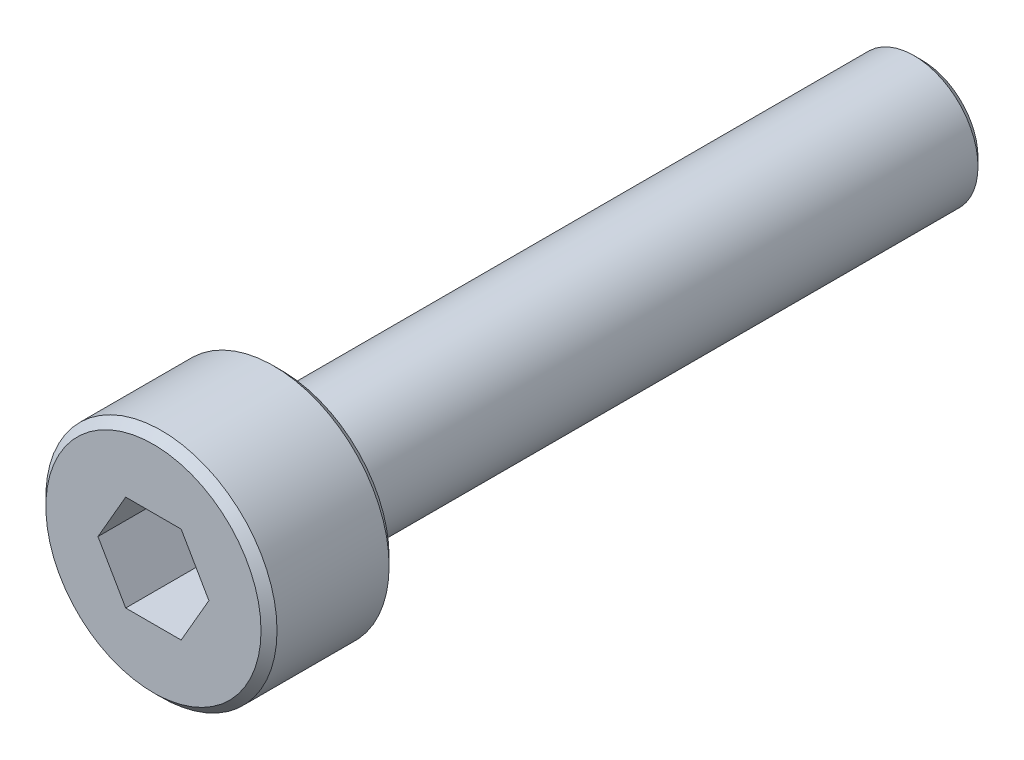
from build123d import *

# Parameters (mm, degrees)
SKETCH1_R           = 2
BOSS_EXTRUDE1_DEPTH = 20
SKETCH2_R           = 3.61
BOSS_EXTRUDE2_DEPTH = 4
CUT_EXTRUDE1_DEPTH  = 2.5
CHAMFER1_SIZE       = 0.25


with BuildPart() as part:
    # Sketch1 → Boss-Extrude1 (new body)
    with BuildSketch(Plane(origin=(0, 0, 0), x_dir=(0, 1, 0), z_dir=(0, 0, 1))):
        with Locations(Location((0, 0, 0), (0, 0, 270))):
            Circle(SKETCH1_R)
    extrude(amount=BOSS_EXTRUDE1_DEPTH)

    # Sketch2 → Boss-Extrude2 (add)
    with BuildSketch(Plane.XY.offset(20)):
        Circle(SKETCH2_R)
    extrude(amount=BOSS_EXTRUDE2_DEPTH)

    # Sketch3 → Cut-Extrude1 (cut)
    with BuildSketch(Plane.XY.offset(24)):
        Polygon((1.732050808, 0), (0.866025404, 1.5), (-0.866025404, 1.5), (-1.732050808, 0), (-0.866025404, -1.5), (0.866025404, -1.5), align=None)
    extrude(amount=-CUT_EXTRUDE1_DEPTH, mode=Mode.SUBTRACT)

    # Chamfer1
    chamfer1_edges = [part.edges().sort_by_distance(p)[0] for p in [
        (-2, 0, 0),
        (-3.61, 0, 20),
        (-3.61, 0, 24),
    ]]
    chamfer(chamfer1_edges, length=CHAMFER1_SIZE)


solid = part.part
